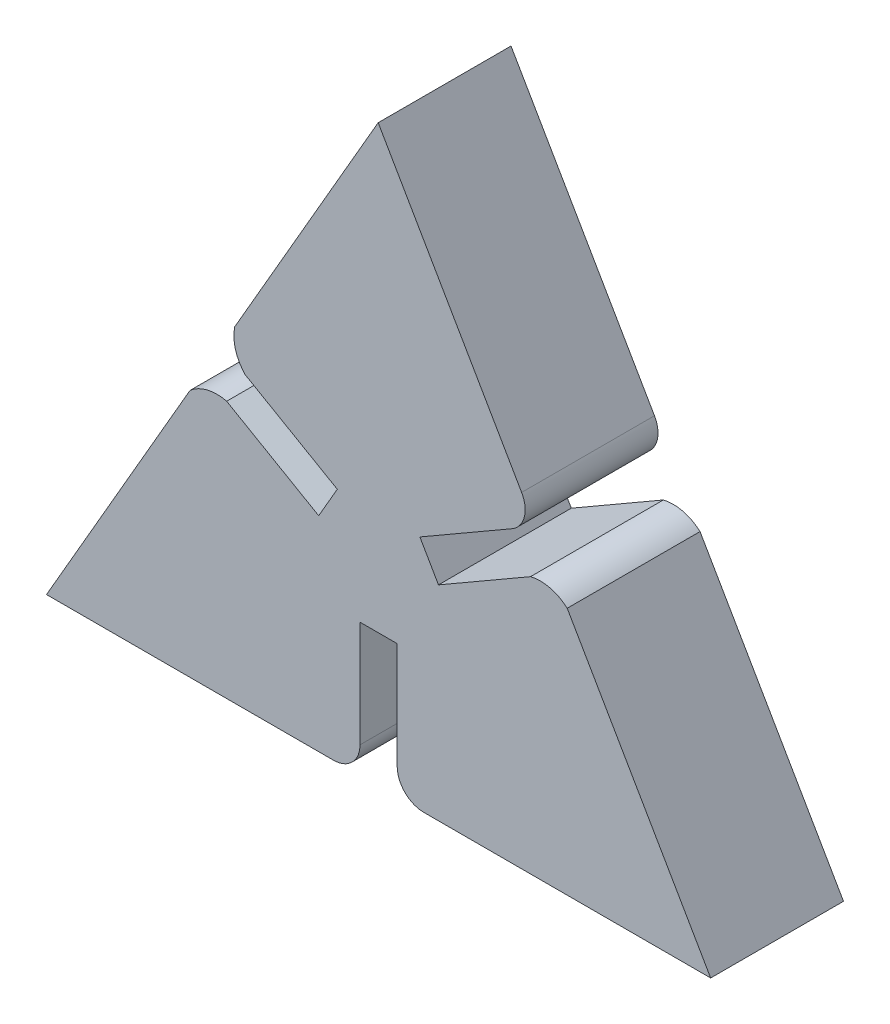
ISO-10303-21;
HEADER;
FILE_DESCRIPTION(('STEP AP214'),'2;1');
FILE_NAME('part.step','',(''),(''),'','','');
FILE_SCHEMA(('AUTOMOTIVE_DESIGN { 1 0 10303 214 1 1 1 1 }'));
ENDSEC;
DATA;
#1=APPLICATION_CONTEXT('core data for automotive mechanical design processes');
#2=APPLICATION_PROTOCOL_DEFINITION('international standard','automotive_design',2000,#1);
#3=PRODUCT_CONTEXT('',#1,'mechanical');
#4=PRODUCT('Part','Part','',(#3));
#5=PRODUCT_RELATED_PRODUCT_CATEGORY('part','',(#4));
#6=PRODUCT_DEFINITION_FORMATION('','',#4);
#7=PRODUCT_DEFINITION_CONTEXT('part definition',#1,'design');
#8=PRODUCT_DEFINITION('design','',#6,#7);
#9=PRODUCT_DEFINITION_SHAPE('','',#8);
#10=(LENGTH_UNIT() NAMED_UNIT(*) SI_UNIT(.MILLI.,.METRE.));
#11=(NAMED_UNIT(*) PLANE_ANGLE_UNIT() SI_UNIT($,.RADIAN.));
#12=(NAMED_UNIT(*) SI_UNIT($,.STERADIAN.) SOLID_ANGLE_UNIT());
#13=UNCERTAINTY_MEASURE_WITH_UNIT(LENGTH_MEASURE(1.E-05),#10,'distance_accuracy_value','');
#14=(GEOMETRIC_REPRESENTATION_CONTEXT(3) GLOBAL_UNCERTAINTY_ASSIGNED_CONTEXT((#13)) GLOBAL_UNIT_ASSIGNED_CONTEXT((#10,
#11,#12)) REPRESENTATION_CONTEXT('',''));
#15=CARTESIAN_POINT('',(0.,0.,0.));
#16=DIRECTION('',(0.,0.,1.));
#17=DIRECTION('',(1.,0.,0.));
#18=AXIS2_PLACEMENT_3D('',#15,#16,#17);
#19=CARTESIAN_POINT('',(-25.,-26.8655559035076,10.));
#20=DIRECTION('',(0.,1.,0.));
#21=DIRECTION('',(-1.,0.,0.));
#22=AXIS2_PLACEMENT_3D('',#19,#20,#21);
#23=PLANE('',#22);
#24=DIRECTION('',(1.,0.,0.));
#25=VECTOR('',#24,1.);
#26=CARTESIAN_POINT('',(-25.,-26.8655559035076,0.));
#27=LINE('',#26,#25);
#28=CARTESIAN_POINT('',(-25.,-26.8655559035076,0.));
#29=VERTEX_POINT('',#28);
#30=CARTESIAN_POINT('',(-3.4,-26.8655559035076,0.));
#31=VERTEX_POINT('',#30);
#32=EDGE_CURVE('E207',#29,#31,#27,.T.);
#33=ORIENTED_EDGE('',*,*,#32,.T.);
#34=DIRECTION('',(0.,0.,-1.));
#35=VECTOR('',#34,1.);
#36=CARTESIAN_POINT('',(-3.4,-26.8655559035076,10.));
#37=LINE('',#36,#35);
#38=CARTESIAN_POINT('',(-3.4,-26.8655559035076,10.));
#39=VERTEX_POINT('',#38);
#40=EDGE_CURVE('E11',#39,#31,#37,.T.);
#41=ORIENTED_EDGE('',*,*,#40,.F.);
#42=DIRECTION('',(1.,0.,0.));
#43=VECTOR('',#42,1.);
#44=CARTESIAN_POINT('',(-25.,-26.8655559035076,10.));
#45=LINE('',#44,#43);
#46=CARTESIAN_POINT('',(-25.,-26.8655559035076,10.));
#47=VERTEX_POINT('',#46);
#48=EDGE_CURVE('E247',#47,#39,#45,.T.);
#49=ORIENTED_EDGE('',*,*,#48,.F.);
#50=DIRECTION('',(0.,0.,-1.));
#51=VECTOR('',#50,1.);
#52=CARTESIAN_POINT('',(-25.,-26.8655559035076,10.));
#53=LINE('',#52,#51);
#54=EDGE_CURVE('E203',#47,#29,#53,.T.);
#55=ORIENTED_EDGE('',*,*,#54,.T.);
#56=EDGE_LOOP('',(#33,#41,#49,#55));
#57=FACE_BOUND('',#56,.T.);
#58=ADVANCED_FACE('F33',(#57),#23,.F.);
#59=CARTESIAN_POINT('',(-3.4,-24.8655559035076,10.));
#60=DIRECTION('',(0.,0.,-1.));
#61=DIRECTION('',(-1.,0.,0.));
#62=AXIS2_PLACEMENT_3D('',#59,#60,#61);
#63=CYLINDRICAL_SURFACE('',#62,2.);
#64=CARTESIAN_POINT('',(-3.4,-24.8655559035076,0.));
#65=DIRECTION('',(0.,0.,1.));
#66=DIRECTION('',(-1.,0.,0.));
#67=AXIS2_PLACEMENT_3D('',#64,#65,#66);
#68=CIRCLE('',#67,2.);
#69=CARTESIAN_POINT('',(-1.4,-24.8655559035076,0.));
#70=VERTEX_POINT('',#69);
#71=EDGE_CURVE('E210',#31,#70,#68,.T.);
#72=ORIENTED_EDGE('',*,*,#71,.T.);
#73=DIRECTION('',(0.,0.,-1.));
#74=VECTOR('',#73,1.);
#75=CARTESIAN_POINT('',(-1.4,-24.8655559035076,10.));
#76=LINE('',#75,#74);
#77=CARTESIAN_POINT('',(-1.4,-24.8655559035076,10.));
#78=VERTEX_POINT('',#77);
#79=EDGE_CURVE('E41',#78,#70,#76,.T.);
#80=ORIENTED_EDGE('',*,*,#79,.F.);
#81=CARTESIAN_POINT('',(-3.4,-24.8655559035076,10.));
#82=DIRECTION('',(0.,0.,1.));
#83=DIRECTION('',(-1.,0.,0.));
#84=AXIS2_PLACEMENT_3D('',#81,#82,#83);
#85=CIRCLE('',#84,2.);
#86=EDGE_CURVE('E131',#39,#78,#85,.T.);
#87=ORIENTED_EDGE('',*,*,#86,.F.);
#88=ORIENTED_EDGE('',*,*,#40,.T.);
#89=EDGE_LOOP('',(#72,#80,#87,#88));
#90=FACE_BOUND('',#89,.T.);
#91=ADVANCED_FACE('F370',(#90),#63,.T.);
#92=CARTESIAN_POINT('',(-1.4,-16.8655559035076,10.));
#93=DIRECTION('',(-1.,0.,0.));
#94=DIRECTION('',(0.,-1.,0.));
#95=AXIS2_PLACEMENT_3D('',#92,#93,#94);
#96=PLANE('',#95);
#97=DIRECTION('',(0.,1.,0.));
#98=VECTOR('',#97,1.);
#99=CARTESIAN_POINT('',(-1.4,-16.8655559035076,0.));
#100=LINE('',#99,#98);
#101=CARTESIAN_POINT('',(-1.4,-16.8655559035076,0.));
#102=VERTEX_POINT('',#101);
#103=EDGE_CURVE('E212',#70,#102,#100,.T.);
#104=ORIENTED_EDGE('',*,*,#103,.T.);
#105=DIRECTION('',(0.,0.,-1.));
#106=VECTOR('',#105,1.);
#107=CARTESIAN_POINT('',(-1.4,-16.8655559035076,10.));
#108=LINE('',#107,#106);
#109=CARTESIAN_POINT('',(-1.4,-16.8655559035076,10.));
#110=VERTEX_POINT('',#109);
#111=EDGE_CURVE('E293',#110,#102,#108,.T.);
#112=ORIENTED_EDGE('',*,*,#111,.F.);
#113=DIRECTION('',(0.,1.,0.));
#114=VECTOR('',#113,1.);
#115=CARTESIAN_POINT('',(-1.4,-16.8655559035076,10.));
#116=LINE('',#115,#114);
#117=EDGE_CURVE('E301',#78,#110,#116,.T.);
#118=ORIENTED_EDGE('',*,*,#117,.F.);
#119=ORIENTED_EDGE('',*,*,#79,.T.);
#120=EDGE_LOOP('',(#104,#112,#118,#119));
#121=FACE_BOUND('',#120,.T.);
#122=ADVANCED_FACE('F299',(#121),#96,.F.);
#123=CARTESIAN_POINT('',(-1.4,-16.8655559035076,10.));
#124=DIRECTION('',(0.,1.,0.));
#125=DIRECTION('',(0.,0.,1.));
#126=AXIS2_PLACEMENT_3D('',#123,#124,#125);
#127=PLANE('',#126);
#128=DIRECTION('',(1.,0.,0.));
#129=VECTOR('',#128,1.);
#130=CARTESIAN_POINT('',(-1.4,-16.8655559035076,0.));
#131=LINE('',#130,#129);
#132=CARTESIAN_POINT('',(1.4,-16.8655559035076,0.));
#133=VERTEX_POINT('',#132);
#134=EDGE_CURVE('E214',#102,#133,#131,.T.);
#135=ORIENTED_EDGE('',*,*,#134,.T.);
#136=DIRECTION('',(0.,0.,-1.));
#137=VECTOR('',#136,1.);
#138=CARTESIAN_POINT('',(1.4,-16.8655559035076,10.));
#139=LINE('',#138,#137);
#140=CARTESIAN_POINT('',(1.4,-16.8655559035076,10.));
#141=VERTEX_POINT('',#140);
#142=EDGE_CURVE('E290',#141,#133,#139,.T.);
#143=ORIENTED_EDGE('',*,*,#142,.F.);
#144=DIRECTION('',(1.,0.,0.));
#145=VECTOR('',#144,1.);
#146=CARTESIAN_POINT('',(-1.4,-16.8655559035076,10.));
#147=LINE('',#146,#145);
#148=EDGE_CURVE('E319',#110,#141,#147,.T.);
#149=ORIENTED_EDGE('',*,*,#148,.F.);
#150=ORIENTED_EDGE('',*,*,#111,.T.);
#151=EDGE_LOOP('',(#135,#143,#149,#150));
#152=FACE_BOUND('',#151,.T.);
#153=ADVANCED_FACE('F310',(#152),#127,.F.);
#154=CARTESIAN_POINT('',(1.4,-16.8655559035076,10.));
#155=DIRECTION('',(1.,0.,0.));
#156=DIRECTION('',(0.,1.,0.));
#157=AXIS2_PLACEMENT_3D('',#154,#155,#156);
#158=PLANE('',#157);
#159=DIRECTION('',(0.,-1.,0.));
#160=VECTOR('',#159,1.);
#161=CARTESIAN_POINT('',(1.4,-16.8655559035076,0.));
#162=LINE('',#161,#160);
#163=CARTESIAN_POINT('',(1.4,-24.8655559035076,0.));
#164=VERTEX_POINT('',#163);
#165=EDGE_CURVE('E216',#133,#164,#162,.T.);
#166=ORIENTED_EDGE('',*,*,#165,.T.);
#167=DIRECTION('',(0.,0.,-1.));
#168=VECTOR('',#167,1.);
#169=CARTESIAN_POINT('',(1.4,-24.8655559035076,10.));
#170=LINE('',#169,#168);
#171=CARTESIAN_POINT('',(1.4,-24.8655559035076,10.));
#172=VERTEX_POINT('',#171);
#173=EDGE_CURVE('E287',#172,#164,#170,.T.);
#174=ORIENTED_EDGE('',*,*,#173,.F.);
#175=DIRECTION('',(0.,-1.,0.));
#176=VECTOR('',#175,1.);
#177=CARTESIAN_POINT('',(1.4,-16.8655559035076,10.));
#178=LINE('',#177,#176);
#179=EDGE_CURVE('E316',#141,#172,#178,.T.);
#180=ORIENTED_EDGE('',*,*,#179,.F.);
#181=ORIENTED_EDGE('',*,*,#142,.T.);
#182=EDGE_LOOP('',(#166,#174,#180,#181));
#183=FACE_BOUND('',#182,.T.);
#184=ADVANCED_FACE('F314',(#183),#158,.F.);
#185=CARTESIAN_POINT('',(3.4,-24.8655559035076,10.));
#186=DIRECTION('',(0.,0.,-1.));
#187=DIRECTION('',(-1.,0.,0.));
#188=AXIS2_PLACEMENT_3D('',#185,#186,#187);
#189=CYLINDRICAL_SURFACE('',#188,2.);
#190=CARTESIAN_POINT('',(3.4,-24.8655559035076,0.));
#191=DIRECTION('',(0.,0.,1.));
#192=DIRECTION('',(1.,0.,0.));
#193=AXIS2_PLACEMENT_3D('',#190,#191,#192);
#194=CIRCLE('',#193,2.);
#195=CARTESIAN_POINT('',(3.4,-26.8655559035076,0.));
#196=VERTEX_POINT('',#195);
#197=EDGE_CURVE('E218',#164,#196,#194,.T.);
#198=ORIENTED_EDGE('',*,*,#197,.T.);
#199=DIRECTION('',(0.,0.,-1.));
#200=VECTOR('',#199,1.);
#201=CARTESIAN_POINT('',(3.4,-26.8655559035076,10.));
#202=LINE('',#201,#200);
#203=CARTESIAN_POINT('',(3.4,-26.8655559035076,10.));
#204=VERTEX_POINT('',#203);
#205=EDGE_CURVE('E284',#204,#196,#202,.T.);
#206=ORIENTED_EDGE('',*,*,#205,.F.);
#207=CARTESIAN_POINT('',(3.4,-24.8655559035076,10.));
#208=DIRECTION('',(0.,0.,1.));
#209=DIRECTION('',(1.,0.,0.));
#210=AXIS2_PLACEMENT_3D('',#207,#208,#209);
#211=CIRCLE('',#210,2.);
#212=EDGE_CURVE('E318',#172,#204,#211,.T.);
#213=ORIENTED_EDGE('',*,*,#212,.F.);
#214=ORIENTED_EDGE('',*,*,#173,.T.);
#215=EDGE_LOOP('',(#198,#206,#213,#214));
#216=FACE_BOUND('',#215,.T.);
#217=ADVANCED_FACE('F383',(#216),#189,.T.);
#218=CARTESIAN_POINT('',(25.,-26.8655559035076,10.));
#219=DIRECTION('',(0.,1.,0.));
#220=DIRECTION('',(-1.,0.,0.));
#221=AXIS2_PLACEMENT_3D('',#218,#219,#220);
#222=PLANE('',#221);
#223=DIRECTION('',(1.,0.,0.));
#224=VECTOR('',#223,1.);
#225=CARTESIAN_POINT('',(25.,-26.8655559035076,0.));
#226=LINE('',#225,#224);
#227=CARTESIAN_POINT('',(25.,-26.8655559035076,0.));
#228=VERTEX_POINT('',#227);
#229=EDGE_CURVE('E220',#196,#228,#226,.T.);
#230=ORIENTED_EDGE('',*,*,#229,.T.);
#231=DIRECTION('',(0.,0.,-1.));
#232=VECTOR('',#231,1.);
#233=CARTESIAN_POINT('',(25.,-26.8655559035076,10.));
#234=LINE('',#233,#232);
#235=CARTESIAN_POINT('',(25.,-26.8655559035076,10.));
#236=VERTEX_POINT('',#235);
#237=EDGE_CURVE('E281',#236,#228,#234,.T.);
#238=ORIENTED_EDGE('',*,*,#237,.F.);
#239=DIRECTION('',(1.,0.,0.));
#240=VECTOR('',#239,1.);
#241=CARTESIAN_POINT('',(25.,-26.8655559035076,10.));
#242=LINE('',#241,#240);
#243=EDGE_CURVE('E321',#204,#236,#242,.T.);
#244=ORIENTED_EDGE('',*,*,#243,.F.);
#245=ORIENTED_EDGE('',*,*,#205,.T.);
#246=EDGE_LOOP('',(#230,#238,#244,#245));
#247=FACE_BOUND('',#246,.T.);
#248=ADVANCED_FACE('F386',(#247),#222,.F.);
#249=CARTESIAN_POINT('',(14.2,-8.15940718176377,10.));
#250=DIRECTION('',(-0.866025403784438,-0.5,0.));
#251=DIRECTION('',(0.5,-0.866025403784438,0.));
#252=AXIS2_PLACEMENT_3D('',#249,#250,#251);
#253=PLANE('',#252);
#254=DIRECTION('',(-0.5,0.866025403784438,0.));
#255=VECTOR('',#254,1.);
#256=CARTESIAN_POINT('',(14.2,-8.15940718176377,0.));
#257=LINE('',#256,#255);
#258=CARTESIAN_POINT('',(14.2,-8.15940718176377,0.));
#259=VERTEX_POINT('',#258);
#260=EDGE_CURVE('E222',#228,#259,#257,.T.);
#261=ORIENTED_EDGE('',*,*,#260,.T.);
#262=DIRECTION('',(0.,0.,-1.));
#263=VECTOR('',#262,1.);
#264=CARTESIAN_POINT('',(14.2,-8.15940718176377,10.));
#265=LINE('',#264,#263);
#266=CARTESIAN_POINT('',(14.2,-8.15940718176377,10.));
#267=VERTEX_POINT('',#266);
#268=EDGE_CURVE('E278',#267,#259,#265,.T.);
#269=ORIENTED_EDGE('',*,*,#268,.F.);
#270=DIRECTION('',(-0.5,0.866025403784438,0.));
#271=VECTOR('',#270,1.);
#272=CARTESIAN_POINT('',(14.2,-8.15940718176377,10.));
#273=LINE('',#272,#271);
#274=EDGE_CURVE('E327',#236,#267,#273,.T.);
#275=ORIENTED_EDGE('',*,*,#274,.F.);
#276=ORIENTED_EDGE('',*,*,#237,.T.);
#277=EDGE_LOOP('',(#261,#269,#275,#276));
#278=FACE_BOUND('',#277,.T.);
#279=ADVANCED_FACE('F390',(#278),#253,.F.);
#280=CARTESIAN_POINT('',(12.1750869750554,-10.4384188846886,10.));
#281=DIRECTION('',(0.,0.,-1.));
#282=DIRECTION('',(-1.,0.,0.));
#283=AXIS2_PLACEMENT_3D('',#280,#281,#282);
#284=CYLINDRICAL_SURFACE('',#283,3.04863364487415);
#285=CARTESIAN_POINT('',(12.1750869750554,-10.4384188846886,0.));
#286=DIRECTION('',(0.,0.,1.));
#287=DIRECTION('',(1.,0.,0.));
#288=AXIS2_PLACEMENT_3D('',#285,#286,#287);
#289=CIRCLE('',#288,3.04863364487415);
#290=CARTESIAN_POINT('',(11.4373241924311,-7.48040043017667,0.));
#291=VERTEX_POINT('',#290);
#292=EDGE_CURVE('E224',#259,#291,#289,.T.);
#293=ORIENTED_EDGE('',*,*,#292,.T.);
#294=DIRECTION('',(0.,0.,-1.));
#295=VECTOR('',#294,1.);
#296=CARTESIAN_POINT('',(11.4373241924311,-7.48040043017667,10.));
#297=LINE('',#296,#295);
#298=CARTESIAN_POINT('',(11.4373241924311,-7.48040043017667,10.));
#299=VERTEX_POINT('',#298);
#300=EDGE_CURVE('E275',#299,#291,#297,.T.);
#301=ORIENTED_EDGE('',*,*,#300,.F.);
#302=CARTESIAN_POINT('',(12.1750869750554,-10.4384188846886,10.));
#303=DIRECTION('',(0.,0.,1.));
#304=DIRECTION('',(1.,0.,0.));
#305=AXIS2_PLACEMENT_3D('',#302,#303,#304);
#306=CIRCLE('',#305,3.04863364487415);
#307=EDGE_CURVE('E329',#267,#299,#306,.T.);
#308=ORIENTED_EDGE('',*,*,#307,.F.);
#309=ORIENTED_EDGE('',*,*,#268,.T.);
#310=EDGE_LOOP('',(#293,#301,#308,#309));
#311=FACE_BOUND('',#310,.T.);
#312=ADVANCED_FACE('F394',(#311),#284,.T.);
#313=CARTESIAN_POINT('',(4.50912096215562,-11.4804004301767,10.));
#314=DIRECTION('',(0.5,-0.866025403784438,0.));
#315=DIRECTION('',(0.866025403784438,0.5,0.));
#316=AXIS2_PLACEMENT_3D('',#313,#314,#315);
#317=PLANE('',#316);
#318=DIRECTION('',(-0.866025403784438,-0.5,0.));
#319=VECTOR('',#318,1.);
#320=CARTESIAN_POINT('',(4.50912096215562,-11.4804004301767,0.));
#321=LINE('',#320,#319);
#322=CARTESIAN_POINT('',(4.50912096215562,-11.4804004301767,0.));
#323=VERTEX_POINT('',#322);
#324=EDGE_CURVE('E226',#291,#323,#321,.T.);
#325=ORIENTED_EDGE('',*,*,#324,.T.);
#326=DIRECTION('',(0.,0.,-1.));
#327=VECTOR('',#326,1.);
#328=CARTESIAN_POINT('',(4.50912096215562,-11.4804004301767,10.));
#329=LINE('',#328,#327);
#330=CARTESIAN_POINT('',(4.50912096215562,-11.4804004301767,10.));
#331=VERTEX_POINT('',#330);
#332=EDGE_CURVE('E272',#331,#323,#329,.T.);
#333=ORIENTED_EDGE('',*,*,#332,.F.);
#334=DIRECTION('',(-0.866025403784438,-0.5,0.));
#335=VECTOR('',#334,1.);
#336=CARTESIAN_POINT('',(4.50912096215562,-11.4804004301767,10.));
#337=LINE('',#336,#335);
#338=EDGE_CURVE('E331',#299,#331,#337,.T.);
#339=ORIENTED_EDGE('',*,*,#338,.F.);
#340=ORIENTED_EDGE('',*,*,#300,.T.);
#341=EDGE_LOOP('',(#325,#333,#339,#340));
#342=FACE_BOUND('',#341,.T.);
#343=ADVANCED_FACE('F398',(#342),#317,.F.);
#344=CARTESIAN_POINT('',(4.50912096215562,-11.4804004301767,10.));
#345=DIRECTION('',(-0.866025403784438,-0.5,0.));
#346=DIRECTION('',(0.5,-0.866025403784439,0.));
#347=AXIS2_PLACEMENT_3D('',#344,#345,#346);
#348=PLANE('',#347);
#349=DIRECTION('',(-0.5,0.866025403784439,0.));
#350=VECTOR('',#349,1.);
#351=CARTESIAN_POINT('',(4.50912096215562,-11.4804004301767,0.));
#352=LINE('',#351,#350);
#353=CARTESIAN_POINT('',(3.10912096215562,-9.05552929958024,0.));
#354=VERTEX_POINT('',#353);
#355=EDGE_CURVE('E228',#323,#354,#352,.T.);
#356=ORIENTED_EDGE('',*,*,#355,.T.);
#357=DIRECTION('',(0.,0.,-1.));
#358=VECTOR('',#357,1.);
#359=CARTESIAN_POINT('',(3.10912096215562,-9.05552929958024,10.));
#360=LINE('',#359,#358);
#361=CARTESIAN_POINT('',(3.10912096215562,-9.05552929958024,10.));
#362=VERTEX_POINT('',#361);
#363=EDGE_CURVE('E269',#362,#354,#360,.T.);
#364=ORIENTED_EDGE('',*,*,#363,.F.);
#365=DIRECTION('',(-0.5,0.866025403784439,0.));
#366=VECTOR('',#365,1.);
#367=CARTESIAN_POINT('',(4.50912096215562,-11.4804004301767,10.));
#368=LINE('',#367,#366);
#369=EDGE_CURVE('E333',#331,#362,#368,.T.);
#370=ORIENTED_EDGE('',*,*,#369,.F.);
#371=ORIENTED_EDGE('',*,*,#332,.T.);
#372=EDGE_LOOP('',(#356,#364,#370,#371));
#373=FACE_BOUND('',#372,.T.);
#374=ADVANCED_FACE('F402',(#373),#348,.F.);
#375=CARTESIAN_POINT('',(3.10912096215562,-9.05552929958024,10.));
#376=DIRECTION('',(-0.5,0.866025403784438,0.));
#377=DIRECTION('',(-0.866025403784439,-0.5,0.));
#378=AXIS2_PLACEMENT_3D('',#375,#376,#377);
#379=PLANE('',#378);
#380=DIRECTION('',(0.866025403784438,0.5,0.));
#381=VECTOR('',#380,1.);
#382=CARTESIAN_POINT('',(3.10912096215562,-9.05552929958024,0.));
#383=LINE('',#382,#381);
#384=CARTESIAN_POINT('',(10.0373241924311,-5.05552929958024,0.));
#385=VERTEX_POINT('',#384);
#386=EDGE_CURVE('E230',#354,#385,#383,.T.);
#387=ORIENTED_EDGE('',*,*,#386,.T.);
#388=DIRECTION('',(0.,0.,-1.));
#389=VECTOR('',#388,1.);
#390=CARTESIAN_POINT('',(10.0373241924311,-5.05552929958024,10.));
#391=LINE('',#390,#389);
#392=CARTESIAN_POINT('',(10.0373241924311,-5.05552929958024,10.));
#393=VERTEX_POINT('',#392);
#394=EDGE_CURVE('E266',#393,#385,#391,.T.);
#395=ORIENTED_EDGE('',*,*,#394,.F.);
#396=DIRECTION('',(0.866025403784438,0.5,0.));
#397=VECTOR('',#396,1.);
#398=CARTESIAN_POINT('',(3.10912096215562,-9.05552929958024,10.));
#399=LINE('',#398,#397);
#400=EDGE_CURVE('E335',#362,#393,#399,.T.);
#401=ORIENTED_EDGE('',*,*,#400,.F.);
#402=ORIENTED_EDGE('',*,*,#363,.T.);
#403=EDGE_LOOP('',(#387,#395,#401,#402));
#404=FACE_BOUND('',#403,.T.);
#405=ADVANCED_FACE('F406',(#404),#379,.F.);
#406=CARTESIAN_POINT('',(9.03732419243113,-3.32347849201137,10.));
#407=DIRECTION('',(0.,0.,-1.));
#408=DIRECTION('',(-1.,0.,0.));
#409=AXIS2_PLACEMENT_3D('',#406,#407,#408);
#410=CYLINDRICAL_SURFACE('',#409,2.);
#411=CARTESIAN_POINT('',(9.03732419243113,-3.32347849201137,0.));
#412=DIRECTION('',(0.,0.,1.));
#413=DIRECTION('',(1.,0.,0.));
#414=AXIS2_PLACEMENT_3D('',#411,#412,#413);
#415=CIRCLE('',#414,2.);
#416=CARTESIAN_POINT('',(10.769375,-2.32347849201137,0.));
#417=VERTEX_POINT('',#416);
#418=EDGE_CURVE('E232',#385,#417,#415,.T.);
#419=ORIENTED_EDGE('',*,*,#418,.T.);
#420=DIRECTION('',(0.,0.,-1.));
#421=VECTOR('',#420,1.);
#422=CARTESIAN_POINT('',(10.769375,-2.32347849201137,10.));
#423=LINE('',#422,#421);
#424=CARTESIAN_POINT('',(10.769375,-2.32347849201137,10.));
#425=VERTEX_POINT('',#424);
#426=EDGE_CURVE('E263',#425,#417,#423,.T.);
#427=ORIENTED_EDGE('',*,*,#426,.F.);
#428=CARTESIAN_POINT('',(9.03732419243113,-3.32347849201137,10.));
#429=DIRECTION('',(0.,0.,1.));
#430=DIRECTION('',(1.,0.,0.));
#431=AXIS2_PLACEMENT_3D('',#428,#429,#430);
#432=CIRCLE('',#431,2.);
#433=EDGE_CURVE('E337',#393,#425,#432,.T.);
#434=ORIENTED_EDGE('',*,*,#433,.F.);
#435=ORIENTED_EDGE('',*,*,#394,.T.);
#436=EDGE_LOOP('',(#419,#427,#434,#435));
#437=FACE_BOUND('',#436,.T.);
#438=ADVANCED_FACE('F410',(#437),#410,.T.);
#439=CARTESIAN_POINT('',(-0.0306249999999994,16.3826702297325,10.));
#440=DIRECTION('',(-0.866025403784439,-0.5,0.));
#441=DIRECTION('',(0.5,-0.866025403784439,0.));
#442=AXIS2_PLACEMENT_3D('',#439,#440,#441);
#443=PLANE('',#442);
#444=DIRECTION('',(-0.5,0.866025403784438,0.));
#445=VECTOR('',#444,1.);
#446=CARTESIAN_POINT('',(-0.0306249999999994,16.3826702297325,0.));
#447=LINE('',#446,#445);
#448=CARTESIAN_POINT('',(-0.0306249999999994,16.3826702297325,0.));
#449=VERTEX_POINT('',#448);
#450=EDGE_CURVE('E234',#417,#449,#447,.T.);
#451=ORIENTED_EDGE('',*,*,#450,.T.);
#452=DIRECTION('',(0.,0.,-1.));
#453=VECTOR('',#452,1.);
#454=CARTESIAN_POINT('',(-0.0306249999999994,16.3826702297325,10.));
#455=LINE('',#454,#453);
#456=CARTESIAN_POINT('',(-0.0306249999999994,16.3826702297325,10.));
#457=VERTEX_POINT('',#456);
#458=EDGE_CURVE('E260',#457,#449,#455,.T.);
#459=ORIENTED_EDGE('',*,*,#458,.F.);
#460=DIRECTION('',(-0.5,0.866025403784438,0.));
#461=VECTOR('',#460,1.);
#462=CARTESIAN_POINT('',(-0.0306249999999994,16.3826702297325,10.));
#463=LINE('',#462,#461);
#464=EDGE_CURVE('E339',#425,#457,#463,.T.);
#465=ORIENTED_EDGE('',*,*,#464,.F.);
#466=ORIENTED_EDGE('',*,*,#426,.T.);
#467=EDGE_LOOP('',(#451,#459,#465,#466));
#468=FACE_BOUND('',#467,.T.);
#469=ADVANCED_FACE('F414',(#468),#443,.F.);
#470=CARTESIAN_POINT('',(-10.830625,-2.32347849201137,10.));
#471=DIRECTION('',(0.866025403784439,-0.5,0.));
#472=DIRECTION('',(0.5,0.866025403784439,0.));
#473=AXIS2_PLACEMENT_3D('',#470,#471,#472);
#474=PLANE('',#473);
#475=DIRECTION('',(-0.5,-0.866025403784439,0.));
#476=VECTOR('',#475,1.);
#477=CARTESIAN_POINT('',(-10.830625,-2.32347849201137,0.));
#478=LINE('',#477,#476);
#479=CARTESIAN_POINT('',(-10.830625,-2.32347849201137,0.));
#480=VERTEX_POINT('',#479);
#481=EDGE_CURVE('E236',#449,#480,#478,.T.);
#482=ORIENTED_EDGE('',*,*,#481,.T.);
#483=DIRECTION('',(0.,0.,-1.));
#484=VECTOR('',#483,1.);
#485=CARTESIAN_POINT('',(-10.830625,-2.32347849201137,10.));
#486=LINE('',#485,#484);
#487=CARTESIAN_POINT('',(-10.830625,-2.32347849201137,10.));
#488=VERTEX_POINT('',#487);
#489=EDGE_CURVE('E257',#488,#480,#486,.T.);
#490=ORIENTED_EDGE('',*,*,#489,.F.);
#491=DIRECTION('',(-0.5,-0.866025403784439,0.));
#492=VECTOR('',#491,1.);
#493=CARTESIAN_POINT('',(-10.830625,-2.32347849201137,10.));
#494=LINE('',#493,#492);
#495=EDGE_CURVE('E341',#457,#488,#494,.T.);
#496=ORIENTED_EDGE('',*,*,#495,.F.);
#497=ORIENTED_EDGE('',*,*,#458,.T.);
#498=EDGE_LOOP('',(#482,#490,#496,#497));
#499=FACE_BOUND('',#498,.T.);
#500=ADVANCED_FACE('F418',(#499),#474,.F.);
#501=CARTESIAN_POINT('',(-7.84448645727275,-2.93759876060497,10.));
#502=DIRECTION('',(0.,0.,-1.));
#503=DIRECTION('',(-1.,0.,0.));
#504=AXIS2_PLACEMENT_3D('',#501,#502,#503);
#505=CYLINDRICAL_SURFACE('',#504,3.04863364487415);
#506=CARTESIAN_POINT('',(-7.84448645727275,-2.93759876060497,0.));
#507=DIRECTION('',(0.,0.,1.));
#508=DIRECTION('',(1.,0.,0.));
#509=AXIS2_PLACEMENT_3D('',#506,#507,#508);
#510=CIRCLE('',#509,3.04863364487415);
#511=CARTESIAN_POINT('',(-10.0373241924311,-5.05552929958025,0.));
#512=VERTEX_POINT('',#511);
#513=EDGE_CURVE('E238',#480,#512,#510,.T.);
#514=ORIENTED_EDGE('',*,*,#513,.T.);
#515=DIRECTION('',(0.,0.,-1.));
#516=VECTOR('',#515,1.);
#517=CARTESIAN_POINT('',(-10.0373241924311,-5.05552929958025,10.));
#518=LINE('',#517,#516);
#519=CARTESIAN_POINT('',(-10.0373241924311,-5.05552929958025,10.));
#520=VERTEX_POINT('',#519);
#521=EDGE_CURVE('E254',#520,#512,#518,.T.);
#522=ORIENTED_EDGE('',*,*,#521,.F.);
#523=CARTESIAN_POINT('',(-7.84448645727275,-2.93759876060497,10.));
#524=DIRECTION('',(0.,0.,1.));
#525=DIRECTION('',(1.,0.,0.));
#526=AXIS2_PLACEMENT_3D('',#523,#524,#525);
#527=CIRCLE('',#526,3.04863364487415);
#528=EDGE_CURVE('E343',#488,#520,#527,.T.);
#529=ORIENTED_EDGE('',*,*,#528,.F.);
#530=ORIENTED_EDGE('',*,*,#489,.T.);
#531=EDGE_LOOP('',(#514,#522,#529,#530));
#532=FACE_BOUND('',#531,.T.);
#533=ADVANCED_FACE('F422',(#532),#505,.T.);
#534=CARTESIAN_POINT('',(-3.10912096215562,-9.05552929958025,10.));
#535=DIRECTION('',(0.5,0.866025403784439,0.));
#536=DIRECTION('',(-0.866025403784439,0.5,0.));
#537=AXIS2_PLACEMENT_3D('',#534,#535,#536);
#538=PLANE('',#537);
#539=DIRECTION('',(0.866025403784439,-0.5,0.));
#540=VECTOR('',#539,1.);
#541=CARTESIAN_POINT('',(-3.10912096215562,-9.05552929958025,0.));
#542=LINE('',#541,#540);
#543=CARTESIAN_POINT('',(-3.10912096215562,-9.05552929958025,0.));
#544=VERTEX_POINT('',#543);
#545=EDGE_CURVE('E240',#512,#544,#542,.T.);
#546=ORIENTED_EDGE('',*,*,#545,.T.);
#547=DIRECTION('',(0.,0.,-1.));
#548=VECTOR('',#547,1.);
#549=CARTESIAN_POINT('',(-3.10912096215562,-9.05552929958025,10.));
#550=LINE('',#549,#548);
#551=CARTESIAN_POINT('',(-3.10912096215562,-9.05552929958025,10.));
#552=VERTEX_POINT('',#551);
#553=EDGE_CURVE('E251',#552,#544,#550,.T.);
#554=ORIENTED_EDGE('',*,*,#553,.F.);
#555=DIRECTION('',(0.866025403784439,-0.5,0.));
#556=VECTOR('',#555,1.);
#557=CARTESIAN_POINT('',(-3.10912096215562,-9.05552929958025,10.));
#558=LINE('',#557,#556);
#559=EDGE_CURVE('E345',#520,#552,#558,.T.);
#560=ORIENTED_EDGE('',*,*,#559,.F.);
#561=ORIENTED_EDGE('',*,*,#521,.T.);
#562=EDGE_LOOP('',(#546,#554,#560,#561));
#563=FACE_BOUND('',#562,.T.);
#564=ADVANCED_FACE('F351',(#563),#538,.F.);
#565=CARTESIAN_POINT('',(-4.50912096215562,-11.4804004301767,10.));
#566=DIRECTION('',(0.866025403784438,-0.500000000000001,0.));
#567=DIRECTION('',(0.500000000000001,0.866025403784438,0.));
#568=AXIS2_PLACEMENT_3D('',#565,#566,#567);
#569=PLANE('',#568);
#570=DIRECTION('',(-0.500000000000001,-0.866025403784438,0.));
#571=VECTOR('',#570,1.);
#572=CARTESIAN_POINT('',(-4.50912096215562,-11.4804004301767,0.));
#573=LINE('',#572,#571);
#574=CARTESIAN_POINT('',(-4.50912096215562,-11.4804004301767,0.));
#575=VERTEX_POINT('',#574);
#576=EDGE_CURVE('E242',#544,#575,#573,.T.);
#577=ORIENTED_EDGE('',*,*,#576,.T.);
#578=DIRECTION('',(0.,0.,-1.));
#579=VECTOR('',#578,1.);
#580=CARTESIAN_POINT('',(-4.50912096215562,-11.4804004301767,10.));
#581=LINE('',#580,#579);
#582=CARTESIAN_POINT('',(-4.50912096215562,-11.4804004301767,10.));
#583=VERTEX_POINT('',#582);
#584=EDGE_CURVE('E198',#583,#575,#581,.T.);
#585=ORIENTED_EDGE('',*,*,#584,.F.);
#586=DIRECTION('',(-0.500000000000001,-0.866025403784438,0.));
#587=VECTOR('',#586,1.);
#588=CARTESIAN_POINT('',(-4.50912096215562,-11.4804004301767,10.));
#589=LINE('',#588,#587);
#590=EDGE_CURVE('E189',#552,#583,#589,.T.);
#591=ORIENTED_EDGE('',*,*,#590,.F.);
#592=ORIENTED_EDGE('',*,*,#553,.T.);
#593=EDGE_LOOP('',(#577,#585,#591,#592));
#594=FACE_BOUND('',#593,.T.);
#595=ADVANCED_FACE('F355',(#594),#569,.F.);
#596=CARTESIAN_POINT('',(-4.50912096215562,-11.4804004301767,10.));
#597=DIRECTION('',(-0.5,-0.866025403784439,0.));
#598=DIRECTION('',(0.866025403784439,-0.5,0.));
#599=AXIS2_PLACEMENT_3D('',#596,#597,#598);
#600=PLANE('',#599);
#601=DIRECTION('',(-0.866025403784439,0.5,0.));
#602=VECTOR('',#601,1.);
#603=CARTESIAN_POINT('',(-4.50912096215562,-11.4804004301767,0.));
#604=LINE('',#603,#602);
#605=CARTESIAN_POINT('',(-11.4373241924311,-7.48040043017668,0.));
#606=VERTEX_POINT('',#605);
#607=EDGE_CURVE('E197',#575,#606,#604,.T.);
#608=ORIENTED_EDGE('',*,*,#607,.T.);
#609=DIRECTION('',(0.,0.,-1.));
#610=VECTOR('',#609,1.);
#611=CARTESIAN_POINT('',(-11.4373241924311,-7.48040043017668,10.));
#612=LINE('',#611,#610);
#613=CARTESIAN_POINT('',(-11.4373241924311,-7.48040043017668,10.));
#614=VERTEX_POINT('',#613);
#615=EDGE_CURVE('E194',#614,#606,#612,.T.);
#616=ORIENTED_EDGE('',*,*,#615,.F.);
#617=DIRECTION('',(-0.866025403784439,0.5,0.));
#618=VECTOR('',#617,1.);
#619=CARTESIAN_POINT('',(-4.50912096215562,-11.4804004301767,10.));
#620=LINE('',#619,#618);
#621=EDGE_CURVE('E183',#583,#614,#620,.T.);
#622=ORIENTED_EDGE('',*,*,#621,.F.);
#623=ORIENTED_EDGE('',*,*,#584,.T.);
#624=EDGE_LOOP('',(#608,#616,#622,#623));
#625=FACE_BOUND('',#624,.T.);
#626=ADVANCED_FACE('F195',(#625),#600,.F.);
#627=CARTESIAN_POINT('',(-12.1750869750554,-10.4384188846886,10.));
#628=DIRECTION('',(0.,0.,-1.));
#629=DIRECTION('',(-1.,0.,0.));
#630=AXIS2_PLACEMENT_3D('',#627,#628,#629);
#631=CYLINDRICAL_SURFACE('',#630,3.04863364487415);
#632=CARTESIAN_POINT('',(-12.1750869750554,-10.4384188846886,0.));
#633=DIRECTION('',(0.,0.,1.));
#634=DIRECTION('',(-1.,0.,0.));
#635=AXIS2_PLACEMENT_3D('',#632,#633,#634);
#636=CIRCLE('',#635,3.04863364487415);
#637=CARTESIAN_POINT('',(-14.2,-8.15940718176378,0.));
#638=VERTEX_POINT('',#637);
#639=EDGE_CURVE('E117',#606,#638,#636,.T.);
#640=ORIENTED_EDGE('',*,*,#639,.T.);
#641=DIRECTION('',(0.,0.,-1.));
#642=VECTOR('',#641,1.);
#643=CARTESIAN_POINT('',(-14.2,-8.15940718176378,10.));
#644=LINE('',#643,#642);
#645=CARTESIAN_POINT('',(-14.2,-8.15940718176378,10.));
#646=VERTEX_POINT('',#645);
#647=EDGE_CURVE('E199',#646,#638,#644,.T.);
#648=ORIENTED_EDGE('',*,*,#647,.F.);
#649=CARTESIAN_POINT('',(-12.1750869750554,-10.4384188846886,10.));
#650=DIRECTION('',(0.,0.,1.));
#651=DIRECTION('',(-1.,0.,0.));
#652=AXIS2_PLACEMENT_3D('',#649,#650,#651);
#653=CIRCLE('',#652,3.04863364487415);
#654=EDGE_CURVE('E187',#614,#646,#653,.T.);
#655=ORIENTED_EDGE('',*,*,#654,.F.);
#656=ORIENTED_EDGE('',*,*,#615,.T.);
#657=EDGE_LOOP('',(#640,#648,#655,#656));
#658=FACE_BOUND('',#657,.T.);
#659=ADVANCED_FACE('F201',(#658),#631,.T.);
#660=CARTESIAN_POINT('',(-14.2,-8.15940718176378,10.));
#661=DIRECTION('',(0.866025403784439,-0.5,0.));
#662=DIRECTION('',(0.5,0.866025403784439,0.));
#663=AXIS2_PLACEMENT_3D('',#660,#661,#662);
#664=PLANE('',#663);
#665=DIRECTION('',(-0.5,-0.866025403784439,0.));
#666=VECTOR('',#665,1.);
#667=CARTESIAN_POINT('',(-14.2,-8.15940718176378,0.));
#668=LINE('',#667,#666);
#669=EDGE_CURVE('E123',#638,#29,#668,.T.);
#670=ORIENTED_EDGE('',*,*,#669,.T.);
#671=ORIENTED_EDGE('',*,*,#54,.F.);
#672=DIRECTION('',(-0.5,-0.866025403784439,0.));
#673=VECTOR('',#672,1.);
#674=CARTESIAN_POINT('',(-14.2,-8.15940718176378,10.));
#675=LINE('',#674,#673);
#676=EDGE_CURVE('E49',#646,#47,#675,.T.);
#677=ORIENTED_EDGE('',*,*,#676,.F.);
#678=ORIENTED_EDGE('',*,*,#647,.T.);
#679=EDGE_LOOP('',(#670,#671,#677,#678));
#680=FACE_BOUND('',#679,.T.);
#681=ADVANCED_FACE('F359',(#680),#664,.F.);
#682=CARTESIAN_POINT('',(-3.4,-24.8655559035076,10.));
#683=DIRECTION('',(0.,0.,-1.));
#684=DIRECTION('',(-1.,0.,0.));
#685=AXIS2_PLACEMENT_3D('',#682,#683,#684);
#686=PLANE('',#685);
#687=ORIENTED_EDGE('',*,*,#48,.T.);
#688=ORIENTED_EDGE('',*,*,#86,.T.);
#689=ORIENTED_EDGE('',*,*,#117,.T.);
#690=ORIENTED_EDGE('',*,*,#148,.T.);
#691=ORIENTED_EDGE('',*,*,#179,.T.);
#692=ORIENTED_EDGE('',*,*,#212,.T.);
#693=ORIENTED_EDGE('',*,*,#243,.T.);
#694=ORIENTED_EDGE('',*,*,#274,.T.);
#695=ORIENTED_EDGE('',*,*,#307,.T.);
#696=ORIENTED_EDGE('',*,*,#338,.T.);
#697=ORIENTED_EDGE('',*,*,#369,.T.);
#698=ORIENTED_EDGE('',*,*,#400,.T.);
#699=ORIENTED_EDGE('',*,*,#433,.T.);
#700=ORIENTED_EDGE('',*,*,#464,.T.);
#701=ORIENTED_EDGE('',*,*,#495,.T.);
#702=ORIENTED_EDGE('',*,*,#528,.T.);
#703=ORIENTED_EDGE('',*,*,#559,.T.);
#704=ORIENTED_EDGE('',*,*,#590,.T.);
#705=ORIENTED_EDGE('',*,*,#621,.T.);
#706=ORIENTED_EDGE('',*,*,#654,.T.);
#707=ORIENTED_EDGE('',*,*,#676,.T.);
#708=EDGE_LOOP('',(#687,#688,#689,#690,#691,#692,#693,#694,#695,#696,#697,#698,#699,#700,#701,
#702,#703,#704,#705,#706,#707));
#709=FACE_BOUND('',#708,.T.);
#710=ADVANCED_FACE('F185',(#709),#686,.F.);
#711=CARTESIAN_POINT('',(-3.4,-24.8655559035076,0.));
#712=DIRECTION('',(0.,0.,-1.));
#713=DIRECTION('',(-1.,0.,0.));
#714=AXIS2_PLACEMENT_3D('',#711,#712,#713);
#715=PLANE('',#714);
#716=ORIENTED_EDGE('',*,*,#32,.F.);
#717=ORIENTED_EDGE('',*,*,#669,.F.);
#718=ORIENTED_EDGE('',*,*,#639,.F.);
#719=ORIENTED_EDGE('',*,*,#607,.F.);
#720=ORIENTED_EDGE('',*,*,#576,.F.);
#721=ORIENTED_EDGE('',*,*,#545,.F.);
#722=ORIENTED_EDGE('',*,*,#513,.F.);
#723=ORIENTED_EDGE('',*,*,#481,.F.);
#724=ORIENTED_EDGE('',*,*,#450,.F.);
#725=ORIENTED_EDGE('',*,*,#418,.F.);
#726=ORIENTED_EDGE('',*,*,#386,.F.);
#727=ORIENTED_EDGE('',*,*,#355,.F.);
#728=ORIENTED_EDGE('',*,*,#324,.F.);
#729=ORIENTED_EDGE('',*,*,#292,.F.);
#730=ORIENTED_EDGE('',*,*,#260,.F.);
#731=ORIENTED_EDGE('',*,*,#229,.F.);
#732=ORIENTED_EDGE('',*,*,#197,.F.);
#733=ORIENTED_EDGE('',*,*,#165,.F.);
#734=ORIENTED_EDGE('',*,*,#134,.F.);
#735=ORIENTED_EDGE('',*,*,#103,.F.);
#736=ORIENTED_EDGE('',*,*,#71,.F.);
#737=EDGE_LOOP('',(#716,#717,#718,#719,#720,#721,#722,#723,#724,#725,#726,#727,#728,#729,#730,
#731,#732,#733,#734,#735,#736));
#738=FACE_BOUND('',#737,.T.);
#739=ADVANCED_FACE('F305',(#738),#715,.T.);
#740=CLOSED_SHELL('',(#58,#91,#122,#153,#184,#217,#248,#279,#312,#343,#374,#405,#438,#469,#500,
#533,#564,#595,#626,#659,#681,#710,#739));
#741=MANIFOLD_SOLID_BREP('B2',#740);
#742=ADVANCED_BREP_SHAPE_REPRESENTATION('',(#18,#741),#14);
#743=SHAPE_DEFINITION_REPRESENTATION(#9,#742);
ENDSEC;
END-ISO-10303-21;
